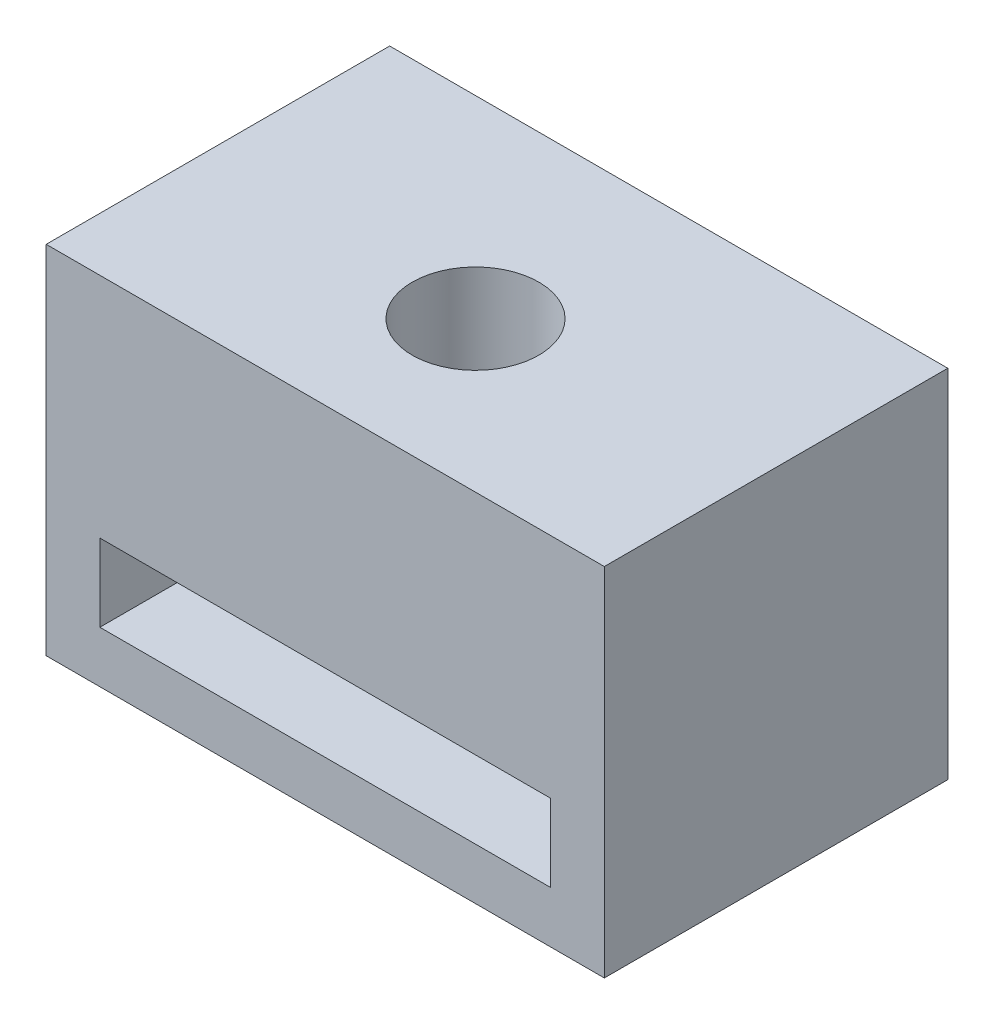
ISO-10303-21;
HEADER;
FILE_DESCRIPTION(('STEP AP214'),'2;1');
FILE_NAME('part.step','',(''),(''),'','','');
FILE_SCHEMA(('AUTOMOTIVE_DESIGN { 1 0 10303 214 1 1 1 1 }'));
ENDSEC;
DATA;
#1=APPLICATION_CONTEXT('core data for automotive mechanical design processes');
#2=APPLICATION_PROTOCOL_DEFINITION('international standard','automotive_design',2000,#1);
#3=PRODUCT_CONTEXT('',#1,'mechanical');
#4=PRODUCT('Part','Part','',(#3));
#5=PRODUCT_RELATED_PRODUCT_CATEGORY('part','',(#4));
#6=PRODUCT_DEFINITION_FORMATION('','',#4);
#7=PRODUCT_DEFINITION_CONTEXT('part definition',#1,'design');
#8=PRODUCT_DEFINITION('design','',#6,#7);
#9=PRODUCT_DEFINITION_SHAPE('','',#8);
#10=(LENGTH_UNIT() NAMED_UNIT(*) SI_UNIT(.MILLI.,.METRE.));
#11=(NAMED_UNIT(*) PLANE_ANGLE_UNIT() SI_UNIT($,.RADIAN.));
#12=(NAMED_UNIT(*) SI_UNIT($,.STERADIAN.) SOLID_ANGLE_UNIT());
#13=UNCERTAINTY_MEASURE_WITH_UNIT(LENGTH_MEASURE(1.E-05),#10,'distance_accuracy_value','');
#14=(GEOMETRIC_REPRESENTATION_CONTEXT(3) GLOBAL_UNCERTAINTY_ASSIGNED_CONTEXT((#13)) GLOBAL_UNIT_ASSIGNED_CONTEXT((#10,
#11,#12)) REPRESENTATION_CONTEXT('',''));
#15=CARTESIAN_POINT('',(0.,0.,0.));
#16=DIRECTION('',(0.,0.,1.));
#17=DIRECTION('',(1.,0.,0.));
#18=AXIS2_PLACEMENT_3D('',#15,#16,#17);
#19=CARTESIAN_POINT('',(0.,0.,8.));
#20=DIRECTION('',(0.,0.,-1.));
#21=DIRECTION('',(-1.,0.,0.));
#22=AXIS2_PLACEMENT_3D('',#19,#20,#21);
#23=PLANE('',#22);
#24=DIRECTION('',(0.,-1.,0.));
#25=VECTOR('',#24,1.);
#26=CARTESIAN_POINT('',(0.,0.,8.));
#27=LINE('',#26,#25);
#28=CARTESIAN_POINT('',(0.,8.3,8.));
#29=VERTEX_POINT('',#28);
#30=CARTESIAN_POINT('',(0.,0.,8.));
#31=VERTEX_POINT('',#30);
#32=EDGE_CURVE('E137',#29,#31,#27,.T.);
#33=ORIENTED_EDGE('',*,*,#32,.T.);
#34=DIRECTION('',(1.,0.,0.));
#35=VECTOR('',#34,1.);
#36=CARTESIAN_POINT('',(0.,0.,8.));
#37=LINE('',#36,#35);
#38=CARTESIAN_POINT('',(13.,0.,8.));
#39=VERTEX_POINT('',#38);
#40=EDGE_CURVE('E140',#31,#39,#37,.T.);
#41=ORIENTED_EDGE('',*,*,#40,.T.);
#42=DIRECTION('',(0.,1.,0.));
#43=VECTOR('',#42,1.);
#44=CARTESIAN_POINT('',(13.,0.,8.));
#45=LINE('',#44,#43);
#46=CARTESIAN_POINT('',(13.,8.3,8.));
#47=VERTEX_POINT('',#46);
#48=EDGE_CURVE('E143',#39,#47,#45,.T.);
#49=ORIENTED_EDGE('',*,*,#48,.T.);
#50=DIRECTION('',(-1.,0.,0.));
#51=VECTOR('',#50,1.);
#52=CARTESIAN_POINT('',(0.,8.3,8.));
#53=LINE('',#52,#51);
#54=EDGE_CURVE('E145',#47,#29,#53,.T.);
#55=ORIENTED_EDGE('',*,*,#54,.T.);
#56=EDGE_LOOP('',(#33,#41,#49,#55));
#57=FACE_BOUND('',#56,.T.);
#58=DIRECTION('',(0.,1.,0.));
#59=VECTOR('',#58,1.);
#60=CARTESIAN_POINT('',(11.75,1.2,8.));
#61=LINE('',#60,#59);
#62=CARTESIAN_POINT('',(11.75,1.2,8.));
#63=VERTEX_POINT('',#62);
#64=CARTESIAN_POINT('',(11.75,3.,8.));
#65=VERTEX_POINT('',#64);
#66=EDGE_CURVE('E99',#63,#65,#61,.T.);
#67=ORIENTED_EDGE('',*,*,#66,.F.);
#68=DIRECTION('',(1.,0.,0.));
#69=VECTOR('',#68,1.);
#70=CARTESIAN_POINT('',(1.25,1.2,8.));
#71=LINE('',#70,#69);
#72=CARTESIAN_POINT('',(1.25,1.2,8.));
#73=VERTEX_POINT('',#72);
#74=EDGE_CURVE('E121',#73,#63,#71,.T.);
#75=ORIENTED_EDGE('',*,*,#74,.F.);
#76=DIRECTION('',(0.,-1.,0.));
#77=VECTOR('',#76,1.);
#78=CARTESIAN_POINT('',(1.25,1.2,8.));
#79=LINE('',#78,#77);
#80=CARTESIAN_POINT('',(1.25,3.,8.));
#81=VERTEX_POINT('',#80);
#82=EDGE_CURVE('E119',#81,#73,#79,.T.);
#83=ORIENTED_EDGE('',*,*,#82,.F.);
#84=DIRECTION('',(-1.,0.,0.));
#85=VECTOR('',#84,1.);
#86=CARTESIAN_POINT('',(1.25,3.,8.));
#87=LINE('',#86,#85);
#88=EDGE_CURVE('E107',#65,#81,#87,.T.);
#89=ORIENTED_EDGE('',*,*,#88,.F.);
#90=EDGE_LOOP('',(#67,#75,#83,#89));
#91=FACE_BOUND('',#90,.T.);
#92=ADVANCED_FACE('F33',(#57,#91),#23,.F.);
#93=CARTESIAN_POINT('',(0.,0.,0.));
#94=DIRECTION('',(0.,0.,-1.));
#95=DIRECTION('',(-1.,0.,0.));
#96=AXIS2_PLACEMENT_3D('',#93,#94,#95);
#97=PLANE('',#96);
#98=DIRECTION('',(0.,-1.,0.));
#99=VECTOR('',#98,1.);
#100=CARTESIAN_POINT('',(0.,0.,0.));
#101=LINE('',#100,#99);
#102=CARTESIAN_POINT('',(0.,8.3,0.));
#103=VERTEX_POINT('',#102);
#104=CARTESIAN_POINT('',(0.,0.,0.));
#105=VERTEX_POINT('',#104);
#106=EDGE_CURVE('E115',#103,#105,#101,.T.);
#107=ORIENTED_EDGE('',*,*,#106,.F.);
#108=DIRECTION('',(-1.,0.,0.));
#109=VECTOR('',#108,1.);
#110=CARTESIAN_POINT('',(0.,8.3,0.));
#111=LINE('',#110,#109);
#112=CARTESIAN_POINT('',(13.,8.3,0.));
#113=VERTEX_POINT('',#112);
#114=EDGE_CURVE('E141',#113,#103,#111,.T.);
#115=ORIENTED_EDGE('',*,*,#114,.F.);
#116=DIRECTION('',(0.,1.,0.));
#117=VECTOR('',#116,1.);
#118=CARTESIAN_POINT('',(13.,0.,0.));
#119=LINE('',#118,#117);
#120=CARTESIAN_POINT('',(13.,0.,0.));
#121=VERTEX_POINT('',#120);
#122=EDGE_CURVE('E152',#121,#113,#119,.T.);
#123=ORIENTED_EDGE('',*,*,#122,.F.);
#124=DIRECTION('',(1.,0.,0.));
#125=VECTOR('',#124,1.);
#126=CARTESIAN_POINT('',(0.,0.,0.));
#127=LINE('',#126,#125);
#128=EDGE_CURVE('E150',#105,#121,#127,.T.);
#129=ORIENTED_EDGE('',*,*,#128,.F.);
#130=EDGE_LOOP('',(#107,#115,#123,#129));
#131=FACE_BOUND('',#130,.T.);
#132=DIRECTION('',(1.,0.,0.));
#133=VECTOR('',#132,1.);
#134=CARTESIAN_POINT('',(1.25,1.2,0.));
#135=LINE('',#134,#133);
#136=CARTESIAN_POINT('',(1.25,1.2,0.));
#137=VERTEX_POINT('',#136);
#138=CARTESIAN_POINT('',(11.75,1.2,0.));
#139=VERTEX_POINT('',#138);
#140=EDGE_CURVE('E108',#137,#139,#135,.T.);
#141=ORIENTED_EDGE('',*,*,#140,.T.);
#142=DIRECTION('',(0.,1.,0.));
#143=VECTOR('',#142,1.);
#144=CARTESIAN_POINT('',(11.75,1.2,0.));
#145=LINE('',#144,#143);
#146=CARTESIAN_POINT('',(11.75,3.,0.));
#147=VERTEX_POINT('',#146);
#148=EDGE_CURVE('E57',#139,#147,#145,.T.);
#149=ORIENTED_EDGE('',*,*,#148,.T.);
#150=DIRECTION('',(-1.,0.,0.));
#151=VECTOR('',#150,1.);
#152=CARTESIAN_POINT('',(1.25,3.,0.));
#153=LINE('',#152,#151);
#154=CARTESIAN_POINT('',(1.25,3.,0.));
#155=VERTEX_POINT('',#154);
#156=EDGE_CURVE('E114',#147,#155,#153,.T.);
#157=ORIENTED_EDGE('',*,*,#156,.T.);
#158=DIRECTION('',(0.,-1.,0.));
#159=VECTOR('',#158,1.);
#160=CARTESIAN_POINT('',(1.25,1.2,0.));
#161=LINE('',#160,#159);
#162=EDGE_CURVE('E129',#155,#137,#161,.T.);
#163=ORIENTED_EDGE('',*,*,#162,.T.);
#164=EDGE_LOOP('',(#141,#149,#157,#163));
#165=FACE_BOUND('',#164,.T.);
#166=ADVANCED_FACE('F171',(#131,#165),#97,.T.);
#167=CARTESIAN_POINT('',(0.,0.,8.));
#168=DIRECTION('',(1.,0.,0.));
#169=DIRECTION('',(0.,1.,0.));
#170=AXIS2_PLACEMENT_3D('',#167,#168,#169);
#171=PLANE('',#170);
#172=ORIENTED_EDGE('',*,*,#106,.T.);
#173=DIRECTION('',(0.,0.,-1.));
#174=VECTOR('',#173,1.);
#175=CARTESIAN_POINT('',(0.,0.,8.));
#176=LINE('',#175,#174);
#177=EDGE_CURVE('E11',#31,#105,#176,.T.);
#178=ORIENTED_EDGE('',*,*,#177,.F.);
#179=ORIENTED_EDGE('',*,*,#32,.F.);
#180=DIRECTION('',(0.,0.,-1.));
#181=VECTOR('',#180,1.);
#182=CARTESIAN_POINT('',(0.,8.3,8.));
#183=LINE('',#182,#181);
#184=EDGE_CURVE('E147',#29,#103,#183,.T.);
#185=ORIENTED_EDGE('',*,*,#184,.T.);
#186=EDGE_LOOP('',(#172,#178,#179,#185));
#187=FACE_BOUND('',#186,.T.);
#188=ADVANCED_FACE('F35',(#187),#171,.F.);
#189=CARTESIAN_POINT('',(0.,0.,8.));
#190=DIRECTION('',(0.,1.,0.));
#191=DIRECTION('',(0.,0.,1.));
#192=AXIS2_PLACEMENT_3D('',#189,#190,#191);
#193=PLANE('',#192);
#194=CARTESIAN_POINT('',(6.5,0.,4.5));
#195=DIRECTION('',(0.,1.,0.));
#196=DIRECTION('',(-1.,0.,0.));
#197=AXIS2_PLACEMENT_3D('',#194,#195,#196);
#198=CIRCLE('',#197,1.475);
#199=CARTESIAN_POINT('',(5.025,0.,4.5));
#200=VERTEX_POINT('',#199);
#201=EDGE_CURVE('E208',#200,#200,#198,.T.);
#202=ORIENTED_EDGE('',*,*,#201,.T.);
#203=EDGE_LOOP('',(#202));
#204=FACE_BOUND('',#203,.T.);
#205=ORIENTED_EDGE('',*,*,#128,.T.);
#206=DIRECTION('',(0.,0.,-1.));
#207=VECTOR('',#206,1.);
#208=CARTESIAN_POINT('',(13.,0.,8.));
#209=LINE('',#208,#207);
#210=EDGE_CURVE('E42',#39,#121,#209,.T.);
#211=ORIENTED_EDGE('',*,*,#210,.F.);
#212=ORIENTED_EDGE('',*,*,#40,.F.);
#213=ORIENTED_EDGE('',*,*,#177,.T.);
#214=EDGE_LOOP('',(#205,#211,#212,#213));
#215=FACE_BOUND('',#214,.T.);
#216=ADVANCED_FACE('F181',(#204,#215),#193,.F.);
#217=CARTESIAN_POINT('',(13.,0.,8.));
#218=DIRECTION('',(-1.,0.,0.));
#219=DIRECTION('',(0.,-1.,0.));
#220=AXIS2_PLACEMENT_3D('',#217,#218,#219);
#221=PLANE('',#220);
#222=ORIENTED_EDGE('',*,*,#122,.T.);
#223=DIRECTION('',(0.,0.,-1.));
#224=VECTOR('',#223,1.);
#225=CARTESIAN_POINT('',(13.,8.3,8.));
#226=LINE('',#225,#224);
#227=EDGE_CURVE('E157',#47,#113,#226,.T.);
#228=ORIENTED_EDGE('',*,*,#227,.F.);
#229=ORIENTED_EDGE('',*,*,#48,.F.);
#230=ORIENTED_EDGE('',*,*,#210,.T.);
#231=EDGE_LOOP('',(#222,#228,#229,#230));
#232=FACE_BOUND('',#231,.T.);
#233=ADVANCED_FACE('F165',(#232),#221,.F.);
#234=CARTESIAN_POINT('',(0.,8.3,8.));
#235=DIRECTION('',(0.,-1.,0.));
#236=DIRECTION('',(1.,0.,0.));
#237=AXIS2_PLACEMENT_3D('',#234,#235,#236);
#238=PLANE('',#237);
#239=CARTESIAN_POINT('',(6.5,8.3,4.5));
#240=DIRECTION('',(0.,1.,0.));
#241=DIRECTION('',(-1.,0.,0.));
#242=AXIS2_PLACEMENT_3D('',#239,#240,#241);
#243=CIRCLE('',#242,1.475);
#244=CARTESIAN_POINT('',(5.025,8.3,4.5));
#245=VERTEX_POINT('',#244);
#246=EDGE_CURVE('E206',#245,#245,#243,.T.);
#247=ORIENTED_EDGE('',*,*,#246,.F.);
#248=EDGE_LOOP('',(#247));
#249=FACE_BOUND('',#248,.T.);
#250=ORIENTED_EDGE('',*,*,#114,.T.);
#251=ORIENTED_EDGE('',*,*,#184,.F.);
#252=ORIENTED_EDGE('',*,*,#54,.F.);
#253=ORIENTED_EDGE('',*,*,#227,.T.);
#254=EDGE_LOOP('',(#250,#251,#252,#253));
#255=FACE_BOUND('',#254,.T.);
#256=ADVANCED_FACE('F175',(#249,#255),#238,.F.);
#257=CARTESIAN_POINT('',(11.75,1.2,8.));
#258=DIRECTION('',(-1.,0.,0.));
#259=DIRECTION('',(0.,0.,1.));
#260=AXIS2_PLACEMENT_3D('',#257,#258,#259);
#261=PLANE('',#260);
#262=ORIENTED_EDGE('',*,*,#148,.F.);
#263=DIRECTION('',(0.,0.,-1.));
#264=VECTOR('',#263,1.);
#265=CARTESIAN_POINT('',(11.75,1.2,8.));
#266=LINE('',#265,#264);
#267=EDGE_CURVE('E103',#63,#139,#266,.T.);
#268=ORIENTED_EDGE('',*,*,#267,.F.);
#269=ORIENTED_EDGE('',*,*,#66,.T.);
#270=DIRECTION('',(0.,0.,-1.));
#271=VECTOR('',#270,1.);
#272=CARTESIAN_POINT('',(11.75,3.,8.));
#273=LINE('',#272,#271);
#274=EDGE_CURVE('E102',#65,#147,#273,.T.);
#275=ORIENTED_EDGE('',*,*,#274,.T.);
#276=EDGE_LOOP('',(#262,#268,#269,#275));
#277=FACE_BOUND('',#276,.T.);
#278=ADVANCED_FACE('F101',(#277),#261,.T.);
#279=CARTESIAN_POINT('',(1.25,3.,8.));
#280=DIRECTION('',(0.,-1.,0.));
#281=DIRECTION('',(0.,0.,-1.));
#282=AXIS2_PLACEMENT_3D('',#279,#280,#281);
#283=PLANE('',#282);
#284=CARTESIAN_POINT('',(6.5,3.,4.5));
#285=DIRECTION('',(0.,-1.,0.));
#286=DIRECTION('',(0.,0.,-1.));
#287=AXIS2_PLACEMENT_3D('',#284,#285,#286);
#288=CIRCLE('',#287,1.475);
#289=CARTESIAN_POINT('',(6.5,3.,3.025));
#290=VERTEX_POINT('',#289);
#291=EDGE_CURVE('E127',#290,#290,#288,.T.);
#292=ORIENTED_EDGE('',*,*,#291,.F.);
#293=EDGE_LOOP('',(#292));
#294=FACE_BOUND('',#293,.T.);
#295=ORIENTED_EDGE('',*,*,#156,.F.);
#296=ORIENTED_EDGE('',*,*,#274,.F.);
#297=ORIENTED_EDGE('',*,*,#88,.T.);
#298=DIRECTION('',(0.,0.,-1.));
#299=VECTOR('',#298,1.);
#300=CARTESIAN_POINT('',(1.25,3.,8.));
#301=LINE('',#300,#299);
#302=EDGE_CURVE('E116',#81,#155,#301,.T.);
#303=ORIENTED_EDGE('',*,*,#302,.T.);
#304=EDGE_LOOP('',(#295,#296,#297,#303));
#305=FACE_BOUND('',#304,.T.);
#306=ADVANCED_FACE('F111',(#294,#305),#283,.T.);
#307=CARTESIAN_POINT('',(1.25,1.2,8.));
#308=DIRECTION('',(1.,0.,0.));
#309=DIRECTION('',(0.,0.,-1.));
#310=AXIS2_PLACEMENT_3D('',#307,#308,#309);
#311=PLANE('',#310);
#312=ORIENTED_EDGE('',*,*,#162,.F.);
#313=ORIENTED_EDGE('',*,*,#302,.F.);
#314=ORIENTED_EDGE('',*,*,#82,.T.);
#315=DIRECTION('',(0.,0.,-1.));
#316=VECTOR('',#315,1.);
#317=CARTESIAN_POINT('',(1.25,1.2,8.));
#318=LINE('',#317,#316);
#319=EDGE_CURVE('E49',#73,#137,#318,.T.);
#320=ORIENTED_EDGE('',*,*,#319,.T.);
#321=EDGE_LOOP('',(#312,#313,#314,#320));
#322=FACE_BOUND('',#321,.T.);
#323=ADVANCED_FACE('F222',(#322),#311,.T.);
#324=CARTESIAN_POINT('',(1.25,1.2,8.));
#325=DIRECTION('',(0.,1.,0.));
#326=DIRECTION('',(-1.,0.,0.));
#327=AXIS2_PLACEMENT_3D('',#324,#325,#326);
#328=PLANE('',#327);
#329=CARTESIAN_POINT('',(6.5,1.2,4.5));
#330=DIRECTION('',(0.,1.,0.));
#331=DIRECTION('',(-1.,0.,0.));
#332=AXIS2_PLACEMENT_3D('',#329,#330,#331);
#333=CIRCLE('',#332,1.475);
#334=CARTESIAN_POINT('',(5.025,1.2,4.5));
#335=VERTEX_POINT('',#334);
#336=EDGE_CURVE('E37',#335,#335,#333,.T.);
#337=ORIENTED_EDGE('',*,*,#336,.F.);
#338=EDGE_LOOP('',(#337));
#339=FACE_BOUND('',#338,.T.);
#340=ORIENTED_EDGE('',*,*,#140,.F.);
#341=ORIENTED_EDGE('',*,*,#319,.F.);
#342=ORIENTED_EDGE('',*,*,#74,.T.);
#343=ORIENTED_EDGE('',*,*,#267,.T.);
#344=EDGE_LOOP('',(#340,#341,#342,#343));
#345=FACE_BOUND('',#344,.T.);
#346=ADVANCED_FACE('F220',(#339,#345),#328,.T.);
#347=CARTESIAN_POINT('',(6.5,0.,4.5));
#348=DIRECTION('',(0.,1.,0.));
#349=DIRECTION('',(-1.,0.,0.));
#350=AXIS2_PLACEMENT_3D('',#347,#348,#349);
#351=CYLINDRICAL_SURFACE('',#350,1.475);
#352=ORIENTED_EDGE('',*,*,#336,.T.);
#353=EDGE_LOOP('',(#352));
#354=FACE_BOUND('',#353,.T.);
#355=ORIENTED_EDGE('',*,*,#201,.F.);
#356=EDGE_LOOP('',(#355));
#357=FACE_BOUND('',#356,.T.);
#358=ADVANCED_FACE('F217',(#354,#357),#351,.F.);
#359=ORIENTED_EDGE('',*,*,#291,.T.);
#360=EDGE_LOOP('',(#359));
#361=FACE_BOUND('',#360,.T.);
#362=ORIENTED_EDGE('',*,*,#246,.T.);
#363=EDGE_LOOP('',(#362));
#364=FACE_BOUND('',#363,.T.);
#365=ADVANCED_FACE('F234',(#361,#364),#351,.F.);
#366=CLOSED_SHELL('',(#92,#166,#188,#216,#233,#256,#278,#306,#323,#346,#358,#365));
#367=MANIFOLD_SOLID_BREP('B2',#366);
#368=ADVANCED_BREP_SHAPE_REPRESENTATION('',(#18,#367),#14);
#369=SHAPE_DEFINITION_REPRESENTATION(#9,#368);
ENDSEC;
END-ISO-10303-21;
